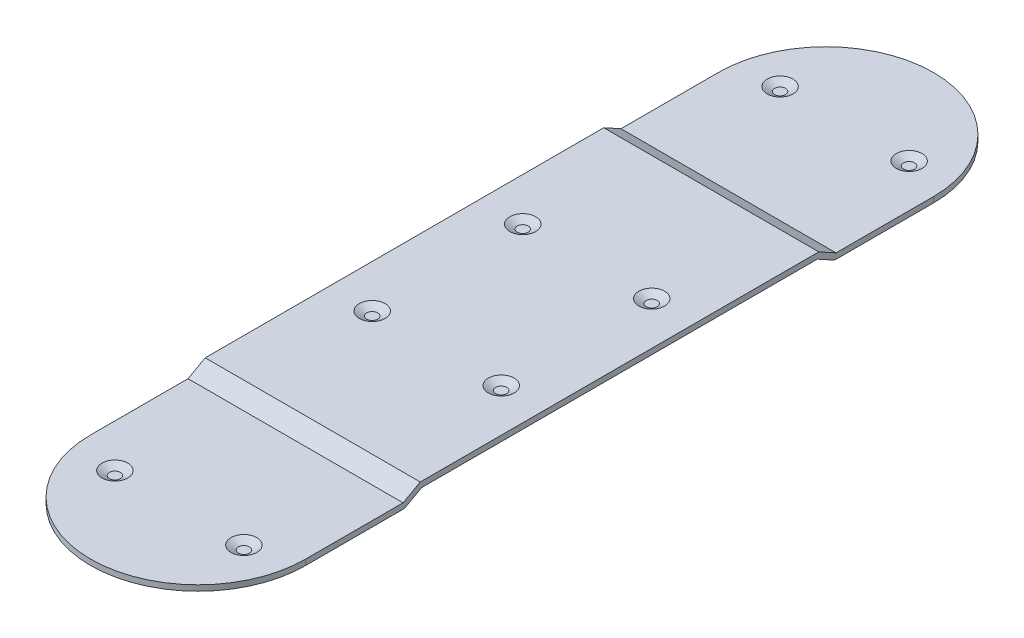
ISO-10303-21;
HEADER;
FILE_DESCRIPTION(('STEP AP214'),'2;1');
FILE_NAME('part.step','',(''),(''),'','','');
FILE_SCHEMA(('AUTOMOTIVE_DESIGN { 1 0 10303 214 1 1 1 1 }'));
ENDSEC;
DATA;
#1=APPLICATION_CONTEXT('core data for automotive mechanical design processes');
#2=APPLICATION_PROTOCOL_DEFINITION('international standard','automotive_design',2000,#1);
#3=PRODUCT_CONTEXT('',#1,'mechanical');
#4=PRODUCT('Part','Part','',(#3));
#5=PRODUCT_RELATED_PRODUCT_CATEGORY('part','',(#4));
#6=PRODUCT_DEFINITION_FORMATION('','',#4);
#7=PRODUCT_DEFINITION_CONTEXT('part definition',#1,'design');
#8=PRODUCT_DEFINITION('design','',#6,#7);
#9=PRODUCT_DEFINITION_SHAPE('','',#8);
#10=(LENGTH_UNIT() NAMED_UNIT(*) SI_UNIT(.MILLI.,.METRE.));
#11=(NAMED_UNIT(*) PLANE_ANGLE_UNIT() SI_UNIT($,.RADIAN.));
#12=(NAMED_UNIT(*) SI_UNIT($,.STERADIAN.) SOLID_ANGLE_UNIT());
#13=UNCERTAINTY_MEASURE_WITH_UNIT(LENGTH_MEASURE(1.E-05),#10,'distance_accuracy_value','');
#14=(GEOMETRIC_REPRESENTATION_CONTEXT(3) GLOBAL_UNCERTAINTY_ASSIGNED_CONTEXT((#13)) GLOBAL_UNIT_ASSIGNED_CONTEXT((#10,
#11,#12)) REPRESENTATION_CONTEXT('',''));
#15=CARTESIAN_POINT('',(0.,0.,0.));
#16=DIRECTION('',(0.,0.,1.));
#17=DIRECTION('',(1.,0.,0.));
#18=AXIS2_PLACEMENT_3D('',#15,#16,#17);
#19=CARTESIAN_POINT('',(1.,-0.19,7.73339137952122));
#20=DIRECTION('',(0.,1.,0.));
#21=DIRECTION('',(0.,0.,1.));
#22=AXIS2_PLACEMENT_3D('',#19,#20,#21);
#23=PLANE('',#22);
#24=CARTESIAN_POINT('',(1.,-0.190000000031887,7.73339137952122));
#25=DIRECTION('',(0.,1.,0.));
#26=DIRECTION('',(0.,0.,1.));
#27=AXIS2_PLACEMENT_3D('',#24,#25,#26);
#28=CIRCLE('',#27,0.126794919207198);
#29=CARTESIAN_POINT('',(1.,-0.190000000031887,7.86018629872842));
#30=VERTEX_POINT('',#29);
#31=EDGE_CURVE('E20',#30,#30,#28,.T.);
#32=ORIENTED_EDGE('',*,*,#31,.T.);
#33=EDGE_LOOP('',(#32));
#34=FACE_BOUND('',#33,.T.);
#35=ADVANCED_FACE('F17',(#34),#23,.T.);
#36=CARTESIAN_POINT('',(4.,-0.19,7.73339137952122));
#37=DIRECTION('',(0.,1.,0.));
#38=DIRECTION('',(0.,0.,1.));
#39=AXIS2_PLACEMENT_3D('',#36,#37,#38);
#40=PLANE('',#39);
#41=CARTESIAN_POINT('',(4.,-0.190000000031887,7.73339137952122));
#42=DIRECTION('',(0.,1.,0.));
#43=DIRECTION('',(0.,0.,1.));
#44=AXIS2_PLACEMENT_3D('',#41,#42,#43);
#45=CIRCLE('',#44,0.126794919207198);
#46=CARTESIAN_POINT('',(4.,-0.190000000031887,7.86018629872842));
#47=VERTEX_POINT('',#46);
#48=EDGE_CURVE('E114',#47,#47,#45,.T.);
#49=ORIENTED_EDGE('',*,*,#48,.T.);
#50=EDGE_LOOP('',(#49));
#51=FACE_BOUND('',#50,.T.);
#52=ADVANCED_FACE('F373',(#51),#40,.T.);
#53=CARTESIAN_POINT('',(1.,0.03,-1.75));
#54=DIRECTION('',(0.,1.,0.));
#55=DIRECTION('',(0.,0.,1.));
#56=AXIS2_PLACEMENT_3D('',#53,#54,#55);
#57=PLANE('',#56);
#58=CARTESIAN_POINT('',(1.,0.0300000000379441,-1.75));
#59=DIRECTION('',(0.,1.,0.));
#60=DIRECTION('',(0.,0.,1.));
#61=AXIS2_PLACEMENT_3D('',#58,#59,#60);
#62=CIRCLE('',#61,0.126794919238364);
#63=CARTESIAN_POINT('',(1.,0.0300000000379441,-1.62320508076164));
#64=VERTEX_POINT('',#63);
#65=EDGE_CURVE('E168',#64,#64,#62,.T.);
#66=ORIENTED_EDGE('',*,*,#65,.T.);
#67=EDGE_LOOP('',(#66));
#68=FACE_BOUND('',#67,.T.);
#69=ADVANCED_FACE('F370',(#68),#57,.T.);
#70=CARTESIAN_POINT('',(4.,0.03,-1.75));
#71=DIRECTION('',(0.,1.,0.));
#72=DIRECTION('',(0.,0.,1.));
#73=AXIS2_PLACEMENT_3D('',#70,#71,#72);
#74=PLANE('',#73);
#75=CARTESIAN_POINT('',(4.,0.0299999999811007,-1.75));
#76=DIRECTION('',(0.,1.,0.));
#77=DIRECTION('',(0.,0.,1.));
#78=AXIS2_PLACEMENT_3D('',#75,#76,#77);
#79=CIRCLE('',#78,0.126794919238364);
#80=CARTESIAN_POINT('',(4.,0.0299999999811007,-1.62320508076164));
#81=VERTEX_POINT('',#80);
#82=EDGE_CURVE('E243',#81,#81,#79,.T.);
#83=ORIENTED_EDGE('',*,*,#82,.T.);
#84=EDGE_LOOP('',(#83));
#85=FACE_BOUND('',#84,.T.);
#86=ADVANCED_FACE('F366',(#85),#74,.T.);
#87=CARTESIAN_POINT('',(4.,0.03,1.75));
#88=DIRECTION('',(0.,1.,0.));
#89=DIRECTION('',(0.,0.,1.));
#90=AXIS2_PLACEMENT_3D('',#87,#88,#89);
#91=PLANE('',#90);
#92=CARTESIAN_POINT('',(4.,0.0299999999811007,1.75));
#93=DIRECTION('',(0.,1.,0.));
#94=DIRECTION('',(0.,0.,1.));
#95=AXIS2_PLACEMENT_3D('',#92,#93,#94);
#96=CIRCLE('',#95,0.126794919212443);
#97=CARTESIAN_POINT('',(4.,0.0299999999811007,1.87679491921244));
#98=VERTEX_POINT('',#97);
#99=EDGE_CURVE('E240',#98,#98,#96,.T.);
#100=ORIENTED_EDGE('',*,*,#99,.T.);
#101=EDGE_LOOP('',(#100));
#102=FACE_BOUND('',#101,.T.);
#103=ADVANCED_FACE('F362',(#102),#91,.T.);
#104=CARTESIAN_POINT('',(1.,0.03,1.75));
#105=DIRECTION('',(0.,1.,0.));
#106=DIRECTION('',(0.,0.,1.));
#107=AXIS2_PLACEMENT_3D('',#104,#105,#106);
#108=PLANE('',#107);
#109=CARTESIAN_POINT('',(1.,0.0299999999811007,1.75));
#110=DIRECTION('',(0.,1.,0.));
#111=DIRECTION('',(0.,0.,1.));
#112=AXIS2_PLACEMENT_3D('',#109,#110,#111);
#113=CIRCLE('',#112,0.126794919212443);
#114=CARTESIAN_POINT('',(1.,0.0299999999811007,1.87679491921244));
#115=VERTEX_POINT('',#114);
#116=EDGE_CURVE('E177',#115,#115,#113,.T.);
#117=ORIENTED_EDGE('',*,*,#116,.T.);
#118=EDGE_LOOP('',(#117));
#119=FACE_BOUND('',#118,.T.);
#120=ADVANCED_FACE('F358',(#119),#108,.T.);
#121=CARTESIAN_POINT('',(4.,-0.19,-7.73339137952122));
#122=DIRECTION('',(0.,1.,0.));
#123=DIRECTION('',(0.,0.,1.));
#124=AXIS2_PLACEMENT_3D('',#121,#122,#123);
#125=PLANE('',#124);
#126=CARTESIAN_POINT('',(4.,-0.189999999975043,-7.73339137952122));
#127=DIRECTION('',(0.,1.,0.));
#128=DIRECTION('',(0.,0.,1.));
#129=AXIS2_PLACEMENT_3D('',#126,#127,#128);
#130=CIRCLE('',#129,0.12679491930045);
#131=CARTESIAN_POINT('',(4.,-0.189999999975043,-7.60659646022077));
#132=VERTEX_POINT('',#131);
#133=EDGE_CURVE('E172',#132,#132,#130,.T.);
#134=ORIENTED_EDGE('',*,*,#133,.T.);
#135=EDGE_LOOP('',(#134));
#136=FACE_BOUND('',#135,.T.);
#137=ADVANCED_FACE('F354',(#136),#125,.T.);
#138=CARTESIAN_POINT('',(1.,-0.19,-7.73339137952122));
#139=DIRECTION('',(0.,1.,0.));
#140=DIRECTION('',(0.,0.,1.));
#141=AXIS2_PLACEMENT_3D('',#138,#139,#140);
#142=PLANE('',#141);
#143=CARTESIAN_POINT('',(1.,-0.190000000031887,-7.73339137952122));
#144=DIRECTION('',(0.,1.,0.));
#145=DIRECTION('',(0.,0.,1.));
#146=AXIS2_PLACEMENT_3D('',#143,#144,#145);
#147=CIRCLE('',#146,0.126794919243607);
#148=CARTESIAN_POINT('',(1.,-0.190000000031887,-7.60659646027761));
#149=VERTEX_POINT('',#148);
#150=EDGE_CURVE('E162',#149,#149,#147,.T.);
#151=ORIENTED_EDGE('',*,*,#150,.T.);
#152=EDGE_LOOP('',(#151));
#153=FACE_BOUND('',#152,.T.);
#154=ADVANCED_FACE('F258',(#153),#142,.T.);
#155=CARTESIAN_POINT('',(1.,-0.0900000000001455,7.73339137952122));
#156=DIRECTION('',(0.,1.,0.));
#157=DIRECTION('',(0.,0.,1.));
#158=AXIS2_PLACEMENT_3D('',#155,#156,#157);
#159=CONICAL_SURFACE('',#158,0.300000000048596,1.04719755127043);
#160=ORIENTED_EDGE('',*,*,#31,.F.);
#161=EDGE_LOOP('',(#160));
#162=FACE_BOUND('',#161,.T.);
#163=CARTESIAN_POINT('',(1.,-0.090000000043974,7.73339137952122));
#164=DIRECTION('',(0.,1.,0.));
#165=DIRECTION('',(0.,0.,1.));
#166=AXIS2_PLACEMENT_3D('',#163,#164,#165);
#167=CIRCLE('',#166,0.299999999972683);
#168=CARTESIAN_POINT('',(1.,-0.090000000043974,8.03339137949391));
#169=VERTEX_POINT('',#168);
#170=EDGE_CURVE('E123',#169,#169,#167,.T.);
#171=ORIENTED_EDGE('',*,*,#170,.T.);
#172=EDGE_LOOP('',(#171));
#173=FACE_BOUND('',#172,.T.);
#174=ADVANCED_FACE('F254',(#162,#173),#159,.F.);
#175=CARTESIAN_POINT('',(4.,-0.0900000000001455,7.73339137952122));
#176=DIRECTION('',(0.,1.,0.));
#177=DIRECTION('',(0.,0.,1.));
#178=AXIS2_PLACEMENT_3D('',#175,#176,#177);
#179=CONICAL_SURFACE('',#178,0.300000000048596,1.04719755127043);
#180=ORIENTED_EDGE('',*,*,#48,.F.);
#181=EDGE_LOOP('',(#180));
#182=FACE_BOUND('',#181,.T.);
#183=CARTESIAN_POINT('',(4.,-0.090000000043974,7.73339137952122));
#184=DIRECTION('',(0.,1.,0.));
#185=DIRECTION('',(0.,0.,1.));
#186=AXIS2_PLACEMENT_3D('',#183,#184,#185);
#187=CIRCLE('',#186,0.299999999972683);
#188=CARTESIAN_POINT('',(4.,-0.090000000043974,8.03339137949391));
#189=VERTEX_POINT('',#188);
#190=EDGE_CURVE('E229',#189,#189,#187,.T.);
#191=ORIENTED_EDGE('',*,*,#190,.T.);
#192=EDGE_LOOP('',(#191));
#193=FACE_BOUND('',#192,.T.);
#194=ADVANCED_FACE('F257',(#182,#193),#179,.F.);
#195=CARTESIAN_POINT('',(2.5,-0.219999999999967,7.3));
#196=DIRECTION('',(0.,1.,0.));
#197=DIRECTION('',(0.,0.,1.));
#198=AXIS2_PLACEMENT_3D('',#195,#196,#197);
#199=CYLINDRICAL_SURFACE('',#198,2.5);
#200=DIRECTION('',(0.,1.,0.));
#201=VECTOR('',#200,1.);
#202=CARTESIAN_POINT('',(0.,-0.219999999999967,7.3));
#203=LINE('',#202,#201);
#204=CARTESIAN_POINT('',(0.,-0.0899999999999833,7.3));
#205=VERTEX_POINT('',#204);
#206=CARTESIAN_POINT('',(0.,-0.22,7.3));
#207=VERTEX_POINT('',#206);
#208=EDGE_CURVE('E113',#205,#207,#203,.F.);
#209=ORIENTED_EDGE('',*,*,#208,.T.);
#210=CARTESIAN_POINT('',(2.5,-0.219999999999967,7.3));
#211=DIRECTION('',(0.,-1.,0.));
#212=DIRECTION('',(0.,0.,-1.));
#213=AXIS2_PLACEMENT_3D('',#210,#211,#212);
#214=CIRCLE('',#213,2.5);
#215=CARTESIAN_POINT('',(5.,-0.219999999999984,7.3));
#216=VERTEX_POINT('',#215);
#217=EDGE_CURVE('E118',#207,#216,#214,.F.);
#218=ORIENTED_EDGE('',*,*,#217,.T.);
#219=DIRECTION('',(0.,-1.,0.));
#220=VECTOR('',#219,1.);
#221=CARTESIAN_POINT('',(5.,0.,7.3));
#222=LINE('',#221,#220);
#223=CARTESIAN_POINT('',(5.,-0.09,7.3));
#224=VERTEX_POINT('',#223);
#225=EDGE_CURVE('E103',#216,#224,#222,.F.);
#226=ORIENTED_EDGE('',*,*,#225,.T.);
#227=CARTESIAN_POINT('',(2.5,-0.0899999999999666,7.3));
#228=DIRECTION('',(0.,1.,0.));
#229=DIRECTION('',(0.,0.,1.));
#230=AXIS2_PLACEMENT_3D('',#227,#228,#229);
#231=CIRCLE('',#230,2.5);
#232=EDGE_CURVE('E226',#224,#205,#231,.F.);
#233=ORIENTED_EDGE('',*,*,#232,.T.);
#234=EDGE_LOOP('',(#209,#218,#226,#233));
#235=FACE_BOUND('',#234,.T.);
#236=ADVANCED_FACE('F119',(#235),#199,.T.);
#237=CARTESIAN_POINT('',(1.,0.130000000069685,-1.75));
#238=DIRECTION('',(0.,1.,0.));
#239=DIRECTION('',(0.,0.,1.));
#240=AXIS2_PLACEMENT_3D('',#237,#238,#239);
#241=CONICAL_SURFACE('',#240,0.300000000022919,1.04719755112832);
#242=ORIENTED_EDGE('',*,*,#65,.F.);
#243=EDGE_LOOP('',(#242));
#244=FACE_BOUND('',#243,.T.);
#245=CARTESIAN_POINT('',(1.,0.130000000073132,-1.75));
#246=DIRECTION('',(0.,1.,0.));
#247=DIRECTION('',(0.,0.,1.));
#248=AXIS2_PLACEMENT_3D('',#245,#246,#247);
#249=CIRCLE('',#248,0.300000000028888);
#250=CARTESIAN_POINT('',(1.,0.130000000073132,-1.44999999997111));
#251=VERTEX_POINT('',#250);
#252=EDGE_CURVE('E223',#251,#251,#249,.T.);
#253=ORIENTED_EDGE('',*,*,#252,.T.);
#254=EDGE_LOOP('',(#253));
#255=FACE_BOUND('',#254,.T.);
#256=ADVANCED_FACE('F342',(#244,#255),#241,.F.);
#257=CARTESIAN_POINT('',(4.,0.129999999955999,-1.75));
#258=DIRECTION('',(0.,1.,0.));
#259=DIRECTION('',(0.,0.,1.));
#260=AXIS2_PLACEMENT_3D('',#257,#258,#259);
#261=CONICAL_SURFACE('',#260,0.299999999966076,1.04719755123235);
#262=ORIENTED_EDGE('',*,*,#82,.F.);
#263=EDGE_LOOP('',(#262));
#264=FACE_BOUND('',#263,.T.);
#265=CARTESIAN_POINT('',(4.,0.129999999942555,-1.75));
#266=DIRECTION('',(0.,1.,0.));
#267=DIRECTION('',(0.,0.,1.));
#268=AXIS2_PLACEMENT_3D('',#265,#266,#267);
#269=CIRCLE('',#268,0.29999999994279);
#270=CARTESIAN_POINT('',(4.,0.129999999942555,-1.45000000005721));
#271=VERTEX_POINT('',#270);
#272=EDGE_CURVE('E220',#271,#271,#269,.T.);
#273=ORIENTED_EDGE('',*,*,#272,.T.);
#274=EDGE_LOOP('',(#273));
#275=FACE_BOUND('',#274,.T.);
#276=ADVANCED_FACE('F338',(#264,#275),#261,.F.);
#277=CARTESIAN_POINT('',(4.,0.130000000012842,1.75));
#278=DIRECTION('',(0.,1.,0.));
#279=DIRECTION('',(0.,0.,1.));
#280=AXIS2_PLACEMENT_3D('',#277,#278,#279);
#281=CONICAL_SURFACE('',#280,0.299999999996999,1.04719755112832);
#282=ORIENTED_EDGE('',*,*,#99,.F.);
#283=EDGE_LOOP('',(#282));
#284=FACE_BOUND('',#283,.T.);
#285=CARTESIAN_POINT('',(4.,0.13000000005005,1.75));
#286=DIRECTION('',(0.,1.,0.));
#287=DIRECTION('',(0.,0.,1.));
#288=AXIS2_PLACEMENT_3D('',#285,#286,#287);
#289=CIRCLE('',#288,0.300000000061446);
#290=CARTESIAN_POINT('',(4.,0.13000000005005,2.05000000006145));
#291=VERTEX_POINT('',#290);
#292=EDGE_CURVE('E217',#291,#291,#289,.T.);
#293=ORIENTED_EDGE('',*,*,#292,.T.);
#294=EDGE_LOOP('',(#293));
#295=FACE_BOUND('',#294,.T.);
#296=ADVANCED_FACE('F334',(#284,#295),#281,.F.);
#297=CARTESIAN_POINT('',(1.,0.130000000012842,1.75));
#298=DIRECTION('',(0.,1.,0.));
#299=DIRECTION('',(0.,0.,1.));
#300=AXIS2_PLACEMENT_3D('',#297,#298,#299);
#301=CONICAL_SURFACE('',#300,0.299999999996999,1.04719755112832);
#302=ORIENTED_EDGE('',*,*,#116,.F.);
#303=EDGE_LOOP('',(#302));
#304=FACE_BOUND('',#303,.T.);
#305=CARTESIAN_POINT('',(1.,0.13000000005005,1.75));
#306=DIRECTION('',(0.,1.,0.));
#307=DIRECTION('',(0.,0.,1.));
#308=AXIS2_PLACEMENT_3D('',#305,#306,#307);
#309=CIRCLE('',#308,0.300000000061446);
#310=CARTESIAN_POINT('',(1.,0.13000000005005,2.05000000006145));
#311=VERTEX_POINT('',#310);
#312=EDGE_CURVE('E184',#311,#311,#309,.T.);
#313=ORIENTED_EDGE('',*,*,#312,.T.);
#314=EDGE_LOOP('',(#313));
#315=FACE_BOUND('',#314,.T.);
#316=ADVANCED_FACE('F326',(#304,#315),#301,.F.);
#317=CARTESIAN_POINT('',(5.,-0.09,5.03339137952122));
#318=DIRECTION('',(0.,-0.876215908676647,-0.481918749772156));
#319=DIRECTION('',(0.,0.481918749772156,-0.876215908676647));
#320=AXIS2_PLACEMENT_3D('',#317,#318,#319);
#321=PLANE('',#320);
#322=DIRECTION('',(1.,0.,0.));
#323=VECTOR('',#322,1.);
#324=CARTESIAN_POINT('',(5.,-0.09,5.03339137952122));
#325=LINE('',#324,#323);
#326=CARTESIAN_POINT('',(0.,-0.09,5.03339137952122));
#327=VERTEX_POINT('',#326);
#328=CARTESIAN_POINT('',(5.,-0.09,5.03339137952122));
#329=VERTEX_POINT('',#328);
#330=EDGE_CURVE('E228',#327,#329,#325,.T.);
#331=ORIENTED_EDGE('',*,*,#330,.T.);
#332=DIRECTION('',(0.,0.481918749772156,-0.876215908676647));
#333=VECTOR('',#332,1.);
#334=CARTESIAN_POINT('',(5.,-0.09,5.03339137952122));
#335=LINE('',#334,#333);
#336=CARTESIAN_POINT('',(5.,0.13,4.63339137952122));
#337=VERTEX_POINT('',#336);
#338=EDGE_CURVE('E173',#337,#329,#335,.F.);
#339=ORIENTED_EDGE('',*,*,#338,.F.);
#340=DIRECTION('',(1.,0.,0.));
#341=VECTOR('',#340,1.);
#342=CARTESIAN_POINT('',(5.,0.13,4.63339137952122));
#343=LINE('',#342,#341);
#344=CARTESIAN_POINT('',(0.,0.13,4.63339137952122));
#345=VERTEX_POINT('',#344);
#346=EDGE_CURVE('E183',#337,#345,#343,.F.);
#347=ORIENTED_EDGE('',*,*,#346,.T.);
#348=DIRECTION('',(0.,0.481918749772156,-0.876215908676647));
#349=VECTOR('',#348,1.);
#350=CARTESIAN_POINT('',(0.,-0.09,5.03339137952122));
#351=LINE('',#350,#349);
#352=EDGE_CURVE('E170',#327,#345,#351,.T.);
#353=ORIENTED_EDGE('',*,*,#352,.F.);
#354=EDGE_LOOP('',(#331,#339,#347,#353));
#355=FACE_BOUND('',#354,.T.);
#356=ADVANCED_FACE('F316',(#355),#321,.F.);
#357=CARTESIAN_POINT('',(4.,-0.0900000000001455,-7.73339137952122));
#358=DIRECTION('',(0.,1.,0.));
#359=DIRECTION('',(0.,0.,1.));
#360=AXIS2_PLACEMENT_3D('',#357,#358,#359);
#361=CONICAL_SURFACE('',#360,0.300000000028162,1.04719755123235);
#362=ORIENTED_EDGE('',*,*,#133,.F.);
#363=EDGE_LOOP('',(#362));
#364=FACE_BOUND('',#363,.T.);
#365=CARTESIAN_POINT('',(4.,-0.0899999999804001,-7.73339137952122));
#366=DIRECTION('',(0.,1.,0.));
#367=DIRECTION('',(0.,0.,1.));
#368=AXIS2_PLACEMENT_3D('',#365,#366,#367);
#369=CIRCLE('',#368,0.300000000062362);
#370=CARTESIAN_POINT('',(4.,-0.0899999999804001,-7.43339137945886));
#371=VERTEX_POINT('',#370);
#372=EDGE_CURVE('E200',#371,#371,#369,.T.);
#373=ORIENTED_EDGE('',*,*,#372,.T.);
#374=EDGE_LOOP('',(#373));
#375=FACE_BOUND('',#374,.T.);
#376=ADVANCED_FACE('F313',(#364,#375),#361,.F.);
#377=CARTESIAN_POINT('',(1.,-0.0900000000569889,-7.73339137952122));
#378=DIRECTION('',(0.,1.,0.));
#379=DIRECTION('',(0.,0.,1.));
#380=AXIS2_PLACEMENT_3D('',#377,#378,#379);
#381=CONICAL_SURFACE('',#380,0.299999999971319,1.04719755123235);
#382=ORIENTED_EDGE('',*,*,#150,.F.);
#383=EDGE_LOOP('',(#382));
#384=FACE_BOUND('',#383,.T.);
#385=CARTESIAN_POINT('',(1.,-0.0900000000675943,-7.73339137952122));
#386=DIRECTION('',(0.,1.,0.));
#387=DIRECTION('',(0.,0.,1.));
#388=AXIS2_PLACEMENT_3D('',#385,#386,#387);
#389=CIRCLE('',#388,0.29999999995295);
#390=CARTESIAN_POINT('',(1.,-0.0900000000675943,-7.43339137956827));
#391=VERTEX_POINT('',#390);
#392=EDGE_CURVE('E210',#391,#391,#389,.T.);
#393=ORIENTED_EDGE('',*,*,#392,.T.);
#394=EDGE_LOOP('',(#393));
#395=FACE_BOUND('',#394,.T.);
#396=ADVANCED_FACE('F315',(#384,#395),#381,.F.);
#397=CARTESIAN_POINT('',(5.,0.13,-4.63339137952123));
#398=DIRECTION('',(0.,-0.876215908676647,0.481918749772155));
#399=DIRECTION('',(0.,-0.481918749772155,-0.876215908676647));
#400=AXIS2_PLACEMENT_3D('',#397,#398,#399);
#401=PLANE('',#400);
#402=DIRECTION('',(1.,0.,0.));
#403=VECTOR('',#402,1.);
#404=CARTESIAN_POINT('',(5.,0.13,-4.63339137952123));
#405=LINE('',#404,#403);
#406=CARTESIAN_POINT('',(0.,0.13,-4.63339137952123));
#407=VERTEX_POINT('',#406);
#408=CARTESIAN_POINT('',(5.,0.13,-4.63339137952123));
#409=VERTEX_POINT('',#408);
#410=EDGE_CURVE('E180',#407,#409,#405,.T.);
#411=ORIENTED_EDGE('',*,*,#410,.T.);
#412=DIRECTION('',(0.,-0.481918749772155,-0.876215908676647));
#413=VECTOR('',#412,1.);
#414=CARTESIAN_POINT('',(5.,0.13,-4.63339137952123));
#415=LINE('',#414,#413);
#416=CARTESIAN_POINT('',(5.,-0.0899999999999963,-5.03339137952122));
#417=VERTEX_POINT('',#416);
#418=EDGE_CURVE('E160',#417,#409,#415,.F.);
#419=ORIENTED_EDGE('',*,*,#418,.F.);
#420=DIRECTION('',(1.,0.,0.));
#421=VECTOR('',#420,1.);
#422=CARTESIAN_POINT('',(5.,-0.0899999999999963,-5.03339137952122));
#423=LINE('',#422,#421);
#424=CARTESIAN_POINT('',(0.,-0.0899999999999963,-5.03339137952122));
#425=VERTEX_POINT('',#424);
#426=EDGE_CURVE('E209',#417,#425,#423,.F.);
#427=ORIENTED_EDGE('',*,*,#426,.T.);
#428=DIRECTION('',(0.,-0.481918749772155,-0.876215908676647));
#429=VECTOR('',#428,1.);
#430=CARTESIAN_POINT('',(0.,0.13,-4.63339137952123));
#431=LINE('',#430,#429);
#432=EDGE_CURVE('E159',#407,#425,#431,.T.);
#433=ORIENTED_EDGE('',*,*,#432,.F.);
#434=EDGE_LOOP('',(#411,#419,#427,#433));
#435=FACE_BOUND('',#434,.T.);
#436=ADVANCED_FACE('F323',(#435),#401,.F.);
#437=CARTESIAN_POINT('',(2.5,-0.0899999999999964,-7.3));
#438=DIRECTION('',(0.,-1.,0.));
#439=DIRECTION('',(0.,0.,-1.));
#440=AXIS2_PLACEMENT_3D('',#437,#438,#439);
#441=CYLINDRICAL_SURFACE('',#440,2.5);
#442=DIRECTION('',(0.,-1.,0.));
#443=VECTOR('',#442,1.);
#444=CARTESIAN_POINT('',(0.,-0.0899999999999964,-7.3));
#445=LINE('',#444,#443);
#446=CARTESIAN_POINT('',(0.,-0.219999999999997,-7.3));
#447=VERTEX_POINT('',#446);
#448=CARTESIAN_POINT('',(0.,-0.0899999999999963,-7.3));
#449=VERTEX_POINT('',#448);
#450=EDGE_CURVE('E124',#447,#449,#445,.F.);
#451=ORIENTED_EDGE('',*,*,#450,.T.);
#452=CARTESIAN_POINT('',(2.5,-0.0899999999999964,-7.3));
#453=DIRECTION('',(0.,1.,0.));
#454=DIRECTION('',(0.,0.,1.));
#455=AXIS2_PLACEMENT_3D('',#452,#453,#454);
#456=CIRCLE('',#455,2.5);
#457=CARTESIAN_POINT('',(5.,-0.0899999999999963,-7.3));
#458=VERTEX_POINT('',#457);
#459=EDGE_CURVE('E206',#449,#458,#456,.F.);
#460=ORIENTED_EDGE('',*,*,#459,.T.);
#461=DIRECTION('',(0.,1.,0.));
#462=VECTOR('',#461,1.);
#463=CARTESIAN_POINT('',(5.,0.,-7.3));
#464=LINE('',#463,#462);
#465=CARTESIAN_POINT('',(5.,-0.219999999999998,-7.3));
#466=VERTEX_POINT('',#465);
#467=EDGE_CURVE('E156',#458,#466,#464,.F.);
#468=ORIENTED_EDGE('',*,*,#467,.T.);
#469=CARTESIAN_POINT('',(2.5,-0.219999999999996,-7.3));
#470=DIRECTION('',(0.,-1.,0.));
#471=DIRECTION('',(0.,0.,-1.));
#472=AXIS2_PLACEMENT_3D('',#469,#470,#471);
#473=CIRCLE('',#472,2.5);
#474=EDGE_CURVE('E203',#466,#447,#473,.F.);
#475=ORIENTED_EDGE('',*,*,#474,.T.);
#476=EDGE_LOOP('',(#451,#460,#468,#475));
#477=FACE_BOUND('',#476,.T.);
#478=ADVANCED_FACE('F275',(#477),#441,.T.);
#479=CARTESIAN_POINT('',(5.,-0.22,9.8));
#480=DIRECTION('',(0.,1.,0.));
#481=DIRECTION('',(0.,0.,1.));
#482=AXIS2_PLACEMENT_3D('',#479,#480,#481);
#483=PLANE('',#482);
#484=ORIENTED_EDGE('',*,*,#217,.F.);
#485=DIRECTION('',(0.,0.,1.));
#486=VECTOR('',#485,1.);
#487=CARTESIAN_POINT('',(0.,-0.220000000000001,0.));
#488=LINE('',#487,#486);
#489=CARTESIAN_POINT('',(0.,-0.220000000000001,5.));
#490=VERTEX_POINT('',#489);
#491=EDGE_CURVE('E517',#490,#207,#488,.T.);
#492=ORIENTED_EDGE('',*,*,#491,.F.);
#493=DIRECTION('',(1.,0.,0.));
#494=VECTOR('',#493,1.);
#495=CARTESIAN_POINT('',(5.,-0.220000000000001,5.));
#496=LINE('',#495,#494);
#497=CARTESIAN_POINT('',(5.,-0.220000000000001,5.));
#498=VERTEX_POINT('',#497);
#499=EDGE_CURVE('E127',#490,#498,#496,.T.);
#500=ORIENTED_EDGE('',*,*,#499,.T.);
#501=DIRECTION('',(0.,0.,1.));
#502=VECTOR('',#501,1.);
#503=CARTESIAN_POINT('',(5.,-0.220000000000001,0.));
#504=LINE('',#503,#502);
#505=EDGE_CURVE('E107',#498,#216,#504,.T.);
#506=ORIENTED_EDGE('',*,*,#505,.T.);
#507=EDGE_LOOP('',(#484,#492,#500,#506));
#508=FACE_BOUND('',#507,.T.);
#509=ADVANCED_FACE('F126',(#508),#483,.F.);
#510=CARTESIAN_POINT('',(5.,-0.09,9.8));
#511=DIRECTION('',(0.,-1.,0.));
#512=DIRECTION('',(0.,0.,-1.));
#513=AXIS2_PLACEMENT_3D('',#510,#511,#512);
#514=PLANE('',#513);
#515=ORIENTED_EDGE('',*,*,#232,.F.);
#516=DIRECTION('',(0.,0.,1.));
#517=VECTOR('',#516,1.);
#518=CARTESIAN_POINT('',(5.,-0.09,0.));
#519=LINE('',#518,#517);
#520=EDGE_CURVE('E110',#224,#329,#519,.F.);
#521=ORIENTED_EDGE('',*,*,#520,.T.);
#522=ORIENTED_EDGE('',*,*,#330,.F.);
#523=DIRECTION('',(0.,0.,1.));
#524=VECTOR('',#523,1.);
#525=CARTESIAN_POINT('',(0.,-0.09,0.));
#526=LINE('',#525,#524);
#527=EDGE_CURVE('E191',#205,#327,#526,.F.);
#528=ORIENTED_EDGE('',*,*,#527,.F.);
#529=EDGE_LOOP('',(#515,#521,#522,#528));
#530=FACE_BOUND('',#529,.T.);
#531=ORIENTED_EDGE('',*,*,#190,.F.);
#532=EDGE_LOOP('',(#531));
#533=FACE_BOUND('',#532,.T.);
#534=ORIENTED_EDGE('',*,*,#170,.F.);
#535=EDGE_LOOP('',(#534));
#536=FACE_BOUND('',#535,.T.);
#537=ADVANCED_FACE('F262',(#530,#533,#536),#514,.F.);
#538=CARTESIAN_POINT('',(5.,0.13,4.63339137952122));
#539=DIRECTION('',(0.,-1.,0.));
#540=DIRECTION('',(0.,0.,-1.));
#541=AXIS2_PLACEMENT_3D('',#538,#539,#540);
#542=PLANE('',#541);
#543=ORIENTED_EDGE('',*,*,#346,.F.);
#544=DIRECTION('',(0.,0.,1.));
#545=VECTOR('',#544,1.);
#546=CARTESIAN_POINT('',(5.,0.13,0.));
#547=LINE('',#546,#545);
#548=EDGE_CURVE('E151',#337,#409,#547,.F.);
#549=ORIENTED_EDGE('',*,*,#548,.T.);
#550=ORIENTED_EDGE('',*,*,#410,.F.);
#551=DIRECTION('',(0.,0.,1.));
#552=VECTOR('',#551,1.);
#553=CARTESIAN_POINT('',(0.,0.13,0.));
#554=LINE('',#553,#552);
#555=EDGE_CURVE('E187',#345,#407,#554,.F.);
#556=ORIENTED_EDGE('',*,*,#555,.F.);
#557=EDGE_LOOP('',(#543,#549,#550,#556));
#558=FACE_BOUND('',#557,.T.);
#559=ORIENTED_EDGE('',*,*,#312,.F.);
#560=EDGE_LOOP('',(#559));
#561=FACE_BOUND('',#560,.T.);
#562=ORIENTED_EDGE('',*,*,#292,.F.);
#563=EDGE_LOOP('',(#562));
#564=FACE_BOUND('',#563,.T.);
#565=ORIENTED_EDGE('',*,*,#272,.F.);
#566=EDGE_LOOP('',(#565));
#567=FACE_BOUND('',#566,.T.);
#568=ORIENTED_EDGE('',*,*,#252,.F.);
#569=EDGE_LOOP('',(#568));
#570=FACE_BOUND('',#569,.T.);
#571=ADVANCED_FACE('F264',(#558,#561,#564,#567,#570),#542,.F.);
#572=CARTESIAN_POINT('',(5.,-0.0899999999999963,-5.03339137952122));
#573=DIRECTION('',(0.,-1.,0.));
#574=DIRECTION('',(0.,0.,-1.));
#575=AXIS2_PLACEMENT_3D('',#572,#573,#574);
#576=PLANE('',#575);
#577=ORIENTED_EDGE('',*,*,#459,.F.);
#578=DIRECTION('',(0.,0.,1.));
#579=VECTOR('',#578,1.);
#580=CARTESIAN_POINT('',(0.,-0.0899999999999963,0.));
#581=LINE('',#580,#579);
#582=EDGE_CURVE('E190',#425,#449,#581,.F.);
#583=ORIENTED_EDGE('',*,*,#582,.F.);
#584=ORIENTED_EDGE('',*,*,#426,.F.);
#585=DIRECTION('',(0.,0.,1.));
#586=VECTOR('',#585,1.);
#587=CARTESIAN_POINT('',(5.,-0.0899999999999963,0.));
#588=LINE('',#587,#586);
#589=EDGE_CURVE('E148',#417,#458,#588,.F.);
#590=ORIENTED_EDGE('',*,*,#589,.T.);
#591=EDGE_LOOP('',(#577,#583,#584,#590));
#592=FACE_BOUND('',#591,.T.);
#593=ORIENTED_EDGE('',*,*,#392,.F.);
#594=EDGE_LOOP('',(#593));
#595=FACE_BOUND('',#594,.T.);
#596=ORIENTED_EDGE('',*,*,#372,.F.);
#597=EDGE_LOOP('',(#596));
#598=FACE_BOUND('',#597,.T.);
#599=ADVANCED_FACE('F272',(#592,#595,#598),#576,.F.);
#600=CARTESIAN_POINT('',(5.,-0.22,-5.));
#601=DIRECTION('',(0.,1.,0.));
#602=DIRECTION('',(0.,0.,1.));
#603=AXIS2_PLACEMENT_3D('',#600,#601,#602);
#604=PLANE('',#603);
#605=ORIENTED_EDGE('',*,*,#474,.F.);
#606=DIRECTION('',(0.,0.,1.));
#607=VECTOR('',#606,1.);
#608=CARTESIAN_POINT('',(5.,-0.219999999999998,0.));
#609=LINE('',#608,#607);
#610=CARTESIAN_POINT('',(5.,-0.22,-5.));
#611=VERTEX_POINT('',#610);
#612=EDGE_CURVE('E132',#466,#611,#609,.T.);
#613=ORIENTED_EDGE('',*,*,#612,.T.);
#614=DIRECTION('',(1.,0.,0.));
#615=VECTOR('',#614,1.);
#616=CARTESIAN_POINT('',(5.,-0.22,-5.));
#617=LINE('',#616,#615);
#618=CARTESIAN_POINT('',(0.,-0.219999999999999,-5.));
#619=VERTEX_POINT('',#618);
#620=EDGE_CURVE('E525',#611,#619,#617,.F.);
#621=ORIENTED_EDGE('',*,*,#620,.T.);
#622=DIRECTION('',(0.,0.,1.));
#623=VECTOR('',#622,1.);
#624=CARTESIAN_POINT('',(0.,-0.219999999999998,0.));
#625=LINE('',#624,#623);
#626=EDGE_CURVE('E503',#447,#619,#625,.T.);
#627=ORIENTED_EDGE('',*,*,#626,.F.);
#628=EDGE_LOOP('',(#605,#613,#621,#627));
#629=FACE_BOUND('',#628,.T.);
#630=ADVANCED_FACE('F298',(#629),#604,.F.);
#631=CARTESIAN_POINT('',(5.,-0.220000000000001,5.));
#632=DIRECTION('',(0.,0.876215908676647,0.481918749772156));
#633=DIRECTION('',(0.,-0.481918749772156,0.876215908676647));
#634=AXIS2_PLACEMENT_3D('',#631,#632,#633);
#635=PLANE('',#634);
#636=DIRECTION('',(1.,0.,0.));
#637=VECTOR('',#636,1.);
#638=CARTESIAN_POINT('',(5.,0.,4.6));
#639=LINE('',#638,#637);
#640=CARTESIAN_POINT('',(0.,0.,4.6));
#641=VERTEX_POINT('',#640);
#642=CARTESIAN_POINT('',(5.,0.,4.6));
#643=VERTEX_POINT('',#642);
#644=EDGE_CURVE('E141',#641,#643,#639,.T.);
#645=ORIENTED_EDGE('',*,*,#644,.T.);
#646=DIRECTION('',(0.,-0.481918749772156,0.876215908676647));
#647=VECTOR('',#646,1.);
#648=CARTESIAN_POINT('',(5.,0.,4.6));
#649=LINE('',#648,#647);
#650=EDGE_CURVE('E128',#643,#498,#649,.T.);
#651=ORIENTED_EDGE('',*,*,#650,.T.);
#652=ORIENTED_EDGE('',*,*,#499,.F.);
#653=DIRECTION('',(0.,-0.481918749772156,0.876215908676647));
#654=VECTOR('',#653,1.);
#655=CARTESIAN_POINT('',(0.,0.,4.6));
#656=LINE('',#655,#654);
#657=EDGE_CURVE('E145',#641,#490,#656,.T.);
#658=ORIENTED_EDGE('',*,*,#657,.F.);
#659=EDGE_LOOP('',(#645,#651,#652,#658));
#660=FACE_BOUND('',#659,.T.);
#661=ADVANCED_FACE('F295',(#660),#635,.F.);
#662=CARTESIAN_POINT('',(5.,0.,0.));
#663=DIRECTION('',(-1.,0.,0.));
#664=DIRECTION('',(0.,0.,1.));
#665=AXIS2_PLACEMENT_3D('',#662,#663,#664);
#666=PLANE('',#665);
#667=ORIENTED_EDGE('',*,*,#225,.F.);
#668=ORIENTED_EDGE('',*,*,#505,.F.);
#669=ORIENTED_EDGE('',*,*,#650,.F.);
#670=DIRECTION('',(0.,0.,1.));
#671=VECTOR('',#670,1.);
#672=CARTESIAN_POINT('',(5.,0.,4.6));
#673=LINE('',#672,#671);
#674=CARTESIAN_POINT('',(5.,0.,-4.6));
#675=VERTEX_POINT('',#674);
#676=EDGE_CURVE('E144',#643,#675,#673,.F.);
#677=ORIENTED_EDGE('',*,*,#676,.T.);
#678=DIRECTION('',(0.,0.481918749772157,0.876215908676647));
#679=VECTOR('',#678,1.);
#680=CARTESIAN_POINT('',(5.,0.,-4.6));
#681=LINE('',#680,#679);
#682=EDGE_CURVE('E130',#675,#611,#681,.F.);
#683=ORIENTED_EDGE('',*,*,#682,.T.);
#684=ORIENTED_EDGE('',*,*,#612,.F.);
#685=ORIENTED_EDGE('',*,*,#467,.F.);
#686=ORIENTED_EDGE('',*,*,#589,.F.);
#687=ORIENTED_EDGE('',*,*,#418,.T.);
#688=ORIENTED_EDGE('',*,*,#548,.F.);
#689=ORIENTED_EDGE('',*,*,#338,.T.);
#690=ORIENTED_EDGE('',*,*,#520,.F.);
#691=EDGE_LOOP('',(#667,#668,#669,#677,#683,#684,#685,#686,#687,#688,#689,#690));
#692=FACE_BOUND('',#691,.T.);
#693=ADVANCED_FACE('F105',(#692),#666,.F.);
#694=CARTESIAN_POINT('',(5.,0.,-4.6));
#695=DIRECTION('',(0.,0.876215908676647,-0.481918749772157));
#696=DIRECTION('',(0.,0.481918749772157,0.876215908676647));
#697=AXIS2_PLACEMENT_3D('',#694,#695,#696);
#698=PLANE('',#697);
#699=ORIENTED_EDGE('',*,*,#620,.F.);
#700=ORIENTED_EDGE('',*,*,#682,.F.);
#701=DIRECTION('',(1.,0.,0.));
#702=VECTOR('',#701,1.);
#703=CARTESIAN_POINT('',(5.,0.,-4.6));
#704=LINE('',#703,#702);
#705=CARTESIAN_POINT('',(0.,0.,-4.6));
#706=VERTEX_POINT('',#705);
#707=EDGE_CURVE('E26',#675,#706,#704,.F.);
#708=ORIENTED_EDGE('',*,*,#707,.T.);
#709=DIRECTION('',(0.,0.481918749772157,0.876215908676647));
#710=VECTOR('',#709,1.);
#711=CARTESIAN_POINT('',(0.,-0.22,-5.));
#712=LINE('',#711,#710);
#713=EDGE_CURVE('E34',#619,#706,#712,.T.);
#714=ORIENTED_EDGE('',*,*,#713,.F.);
#715=EDGE_LOOP('',(#699,#700,#708,#714));
#716=FACE_BOUND('',#715,.T.);
#717=ADVANCED_FACE('F286',(#716),#698,.F.);
#718=CARTESIAN_POINT('',(0.,0.,0.));
#719=DIRECTION('',(-1.,0.,0.));
#720=DIRECTION('',(0.,0.,1.));
#721=AXIS2_PLACEMENT_3D('',#718,#719,#720);
#722=PLANE('',#721);
#723=DIRECTION('',(0.,0.,1.));
#724=VECTOR('',#723,1.);
#725=CARTESIAN_POINT('',(0.,0.,4.6));
#726=LINE('',#725,#724);
#727=EDGE_CURVE('E11',#706,#641,#726,.T.);
#728=ORIENTED_EDGE('',*,*,#727,.T.);
#729=ORIENTED_EDGE('',*,*,#657,.T.);
#730=ORIENTED_EDGE('',*,*,#491,.T.);
#731=ORIENTED_EDGE('',*,*,#208,.F.);
#732=ORIENTED_EDGE('',*,*,#527,.T.);
#733=ORIENTED_EDGE('',*,*,#352,.T.);
#734=ORIENTED_EDGE('',*,*,#555,.T.);
#735=ORIENTED_EDGE('',*,*,#432,.T.);
#736=ORIENTED_EDGE('',*,*,#582,.T.);
#737=ORIENTED_EDGE('',*,*,#450,.F.);
#738=ORIENTED_EDGE('',*,*,#626,.T.);
#739=ORIENTED_EDGE('',*,*,#713,.T.);
#740=EDGE_LOOP('',(#728,#729,#730,#731,#732,#733,#734,#735,#736,#737,#738,#739));
#741=FACE_BOUND('',#740,.T.);
#742=ADVANCED_FACE('F280',(#741),#722,.T.);
#743=CARTESIAN_POINT('',(5.,0.,4.6));
#744=DIRECTION('',(0.,1.,0.));
#745=DIRECTION('',(0.,0.,1.));
#746=AXIS2_PLACEMENT_3D('',#743,#744,#745);
#747=PLANE('',#746);
#748=ORIENTED_EDGE('',*,*,#707,.F.);
#749=ORIENTED_EDGE('',*,*,#676,.F.);
#750=ORIENTED_EDGE('',*,*,#644,.F.);
#751=ORIENTED_EDGE('',*,*,#727,.F.);
#752=EDGE_LOOP('',(#748,#749,#750,#751));
#753=FACE_BOUND('',#752,.T.);
#754=ADVANCED_FACE('F278',(#753),#747,.F.);
#755=CLOSED_SHELL('',(#35,#52,#69,#86,#103,#120,#137,#154,#174,#194,#236,#256,#276,#296,#316,
#356,#376,#396,#436,#478,#509,#537,#571,#599,#630,#661,#693,#717,#742,#754));
#756=MANIFOLD_SOLID_BREP('B1',#755);
#757=ADVANCED_BREP_SHAPE_REPRESENTATION('',(#18,#756),#14);
#758=SHAPE_DEFINITION_REPRESENTATION(#9,#757);
ENDSEC;
END-ISO-10303-21;
